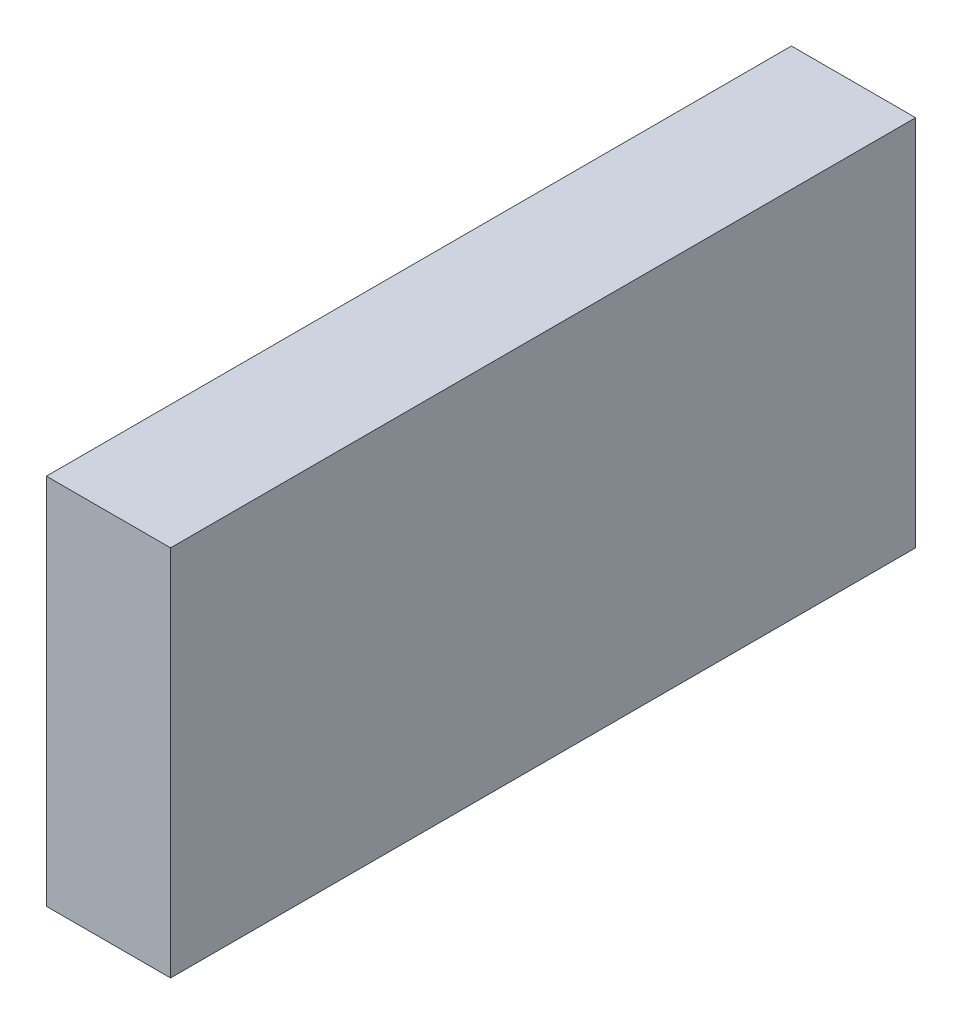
from build123d import *

# Parameters (mm, degrees)
SKETCH1_W           = 76.2
SKETCH1_H           = 38.1
BOSS_EXTRUDE1_DEPTH = 12.7


with BuildPart() as part:
    # Sketch1 → Boss-Extrude1 (new body)
    with BuildSketch(Plane(origin=(0, 0, 0), x_dir=(0, 0, -1), z_dir=(1, 0, 0))):
        with Locations((38.1, 19.05)):
            Rectangle(SKETCH1_W, SKETCH1_H)
    extrude(amount=BOSS_EXTRUDE1_DEPTH)


solid = part.part
